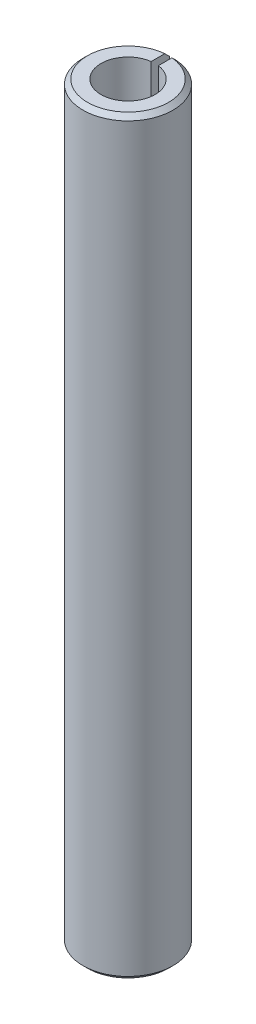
from build123d import *

# Parameters (mm, degrees)
ENL_V_MAT_EXTRU_2_DEPTH      = 13.678722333
ENL_V_MAT_EXTRU_2_DEPTH_BACK = 13.678722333


with BuildPart() as part:
    # Esquisse1 → Base-R_volution (revolve)
    with BuildSketch(Plane.XY):
        Polygon((-0.9, -12.5), (-0.9, 12.5), (-1.35, 12.5), (-1.5, 12.35), (-1.5, -12.35), (-1.35, -12.5), align=None)
    revolve(axis=Axis((0, -12.5, 0), (0, 1, 0)))

    # Esquisse2 → Enl_v. mat.-Extru.2 (cut, two sides: drawn at the far end of the back side and taken through both)
    with BuildSketch(Plane(origin=(0, 0, 0), x_dir=(1, 0, 0), z_dir=(0, 1, 0)).offset(-ENL_V_MAT_EXTRU_2_DEPTH_BACK)):
        with BuildLine():
            Line((-0.12, 1.495192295), (-0.12, 0.891964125))
            ThreePointArc((-0.12, 0.891964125), (0, 0.9), (0.12, 0.891964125))
            Line((0.12, 0.891964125), (0.12, 1.495192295))
            ThreePointArc((0.12, 1.495192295), (0, 1.5), (-0.12, 1.495192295))
        make_face()
    extrude(amount=ENL_V_MAT_EXTRU_2_DEPTH + ENL_V_MAT_EXTRU_2_DEPTH_BACK, mode=Mode.SUBTRACT)


solid = part.part
